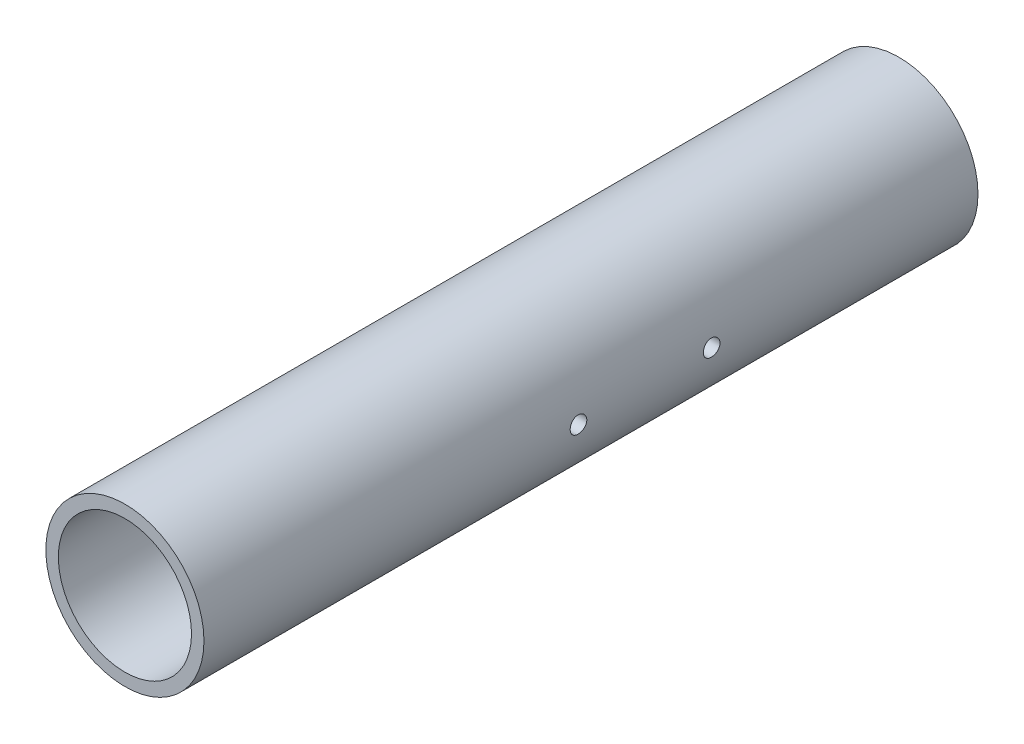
from build123d import *

# Parameters (mm, degrees)
SKETCH1_R               = 30.1625
SKETCH1_R_2             = 25.4
BOSS_EXTRUDE1_DEPTH     = 295.275
CUT_EXTRUDE1_DEPTH      = 299.340205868
CUT_EXTRUDE1_DEPTH_BACK = 299.340205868
SKETCH2_R               = 3.175


with BuildPart() as part:
    # Sketch1 → Boss-Extrude1 (new body)
    with BuildSketch(Plane.XY):
        Circle(SKETCH1_R)
        Circle(SKETCH1_R_2, mode=Mode.SUBTRACT)
    extrude(amount=BOSS_EXTRUDE1_DEPTH)

    # Sketch2 → Cut-Extrude1 (cut, two sides: drawn at the far end of the back side and taken through both)
    with BuildSketch(Plane(origin=(0, 0, 0), x_dir=(0, 0, -1), z_dir=(1, 0, 0)).offset(-CUT_EXTRUDE1_DEPTH_BACK)):
        with Locations((-152.4, 0)):
            Circle(SKETCH2_R)
        with Locations((-101.6, 0)):
            Circle(SKETCH2_R)
    extrude(amount=CUT_EXTRUDE1_DEPTH + CUT_EXTRUDE1_DEPTH_BACK, mode=Mode.SUBTRACT)


solid = part.part
